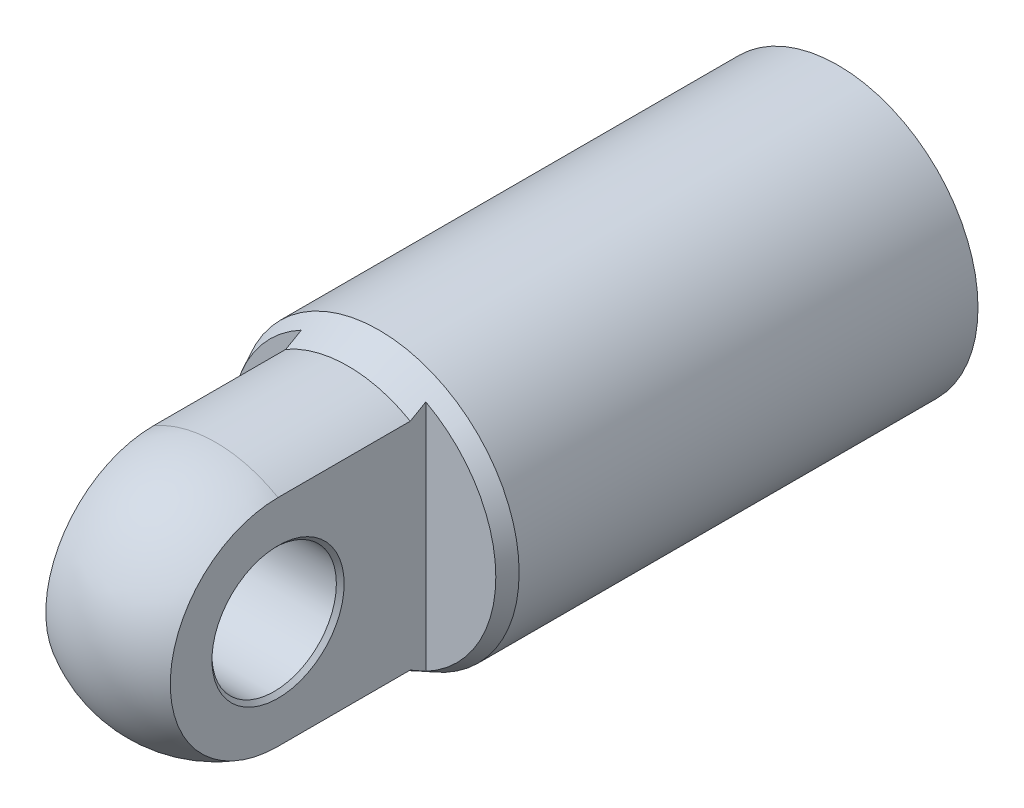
ISO-10303-21;
HEADER;
FILE_DESCRIPTION(('STEP AP214'),'2;1');
FILE_NAME('part.step','',(''),(''),'','','');
FILE_SCHEMA(('AUTOMOTIVE_DESIGN { 1 0 10303 214 1 1 1 1 }'));
ENDSEC;
DATA;
#1=APPLICATION_CONTEXT('core data for automotive mechanical design processes');
#2=APPLICATION_PROTOCOL_DEFINITION('international standard','automotive_design',2000,#1);
#3=PRODUCT_CONTEXT('',#1,'mechanical');
#4=PRODUCT('Part','Part','',(#3));
#5=PRODUCT_RELATED_PRODUCT_CATEGORY('part','',(#4));
#6=PRODUCT_DEFINITION_FORMATION('','',#4);
#7=PRODUCT_DEFINITION_CONTEXT('part definition',#1,'design');
#8=PRODUCT_DEFINITION('design','',#6,#7);
#9=PRODUCT_DEFINITION_SHAPE('','',#8);
#10=(LENGTH_UNIT() NAMED_UNIT(*) SI_UNIT(.MILLI.,.METRE.));
#11=(NAMED_UNIT(*) PLANE_ANGLE_UNIT() SI_UNIT($,.RADIAN.));
#12=(NAMED_UNIT(*) SI_UNIT($,.STERADIAN.) SOLID_ANGLE_UNIT());
#13=UNCERTAINTY_MEASURE_WITH_UNIT(LENGTH_MEASURE(1.E-05),#10,'distance_accuracy_value','');
#14=(GEOMETRIC_REPRESENTATION_CONTEXT(3) GLOBAL_UNCERTAINTY_ASSIGNED_CONTEXT((#13)) GLOBAL_UNIT_ASSIGNED_CONTEXT((#10,
#11,#12)) REPRESENTATION_CONTEXT('',''));
#15=CARTESIAN_POINT('',(0.,0.,0.));
#16=DIRECTION('',(0.,0.,1.));
#17=DIRECTION('',(1.,0.,0.));
#18=AXIS2_PLACEMENT_3D('',#15,#16,#17);
#19=CARTESIAN_POINT('',(4.00000000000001,0.,40.));
#20=DIRECTION('',(1.,0.,0.));
#21=DIRECTION('',(0.,0.,-1.));
#22=AXIS2_PLACEMENT_3D('',#19,#20,#21);
#23=CYLINDRICAL_SURFACE('',#22,4.);
#24=CARTESIAN_POINT('',(-3.75000000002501,0.,40.));
#25=DIRECTION('',(-1.,0.,0.));
#26=DIRECTION('',(0.,0.,1.));
#27=AXIS2_PLACEMENT_3D('',#24,#25,#26);
#28=CIRCLE('',#27,3.99999999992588);
#29=CARTESIAN_POINT('',(-3.75000000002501,0.,43.9999999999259));
#30=VERTEX_POINT('',#29);
#31=EDGE_CURVE('E116',#30,#30,#28,.T.);
#32=ORIENTED_EDGE('',*,*,#31,.T.);
#33=EDGE_LOOP('',(#32));
#34=FACE_BOUND('',#33,.T.);
#35=CARTESIAN_POINT('',(3.74999999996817,0.,40.));
#36=DIRECTION('',(1.,0.,0.));
#37=DIRECTION('',(0.,0.,-1.));
#38=AXIS2_PLACEMENT_3D('',#35,#36,#37);
#39=CIRCLE('',#38,3.99999999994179);
#40=CARTESIAN_POINT('',(3.74999999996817,0.,36.0000000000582));
#41=VERTEX_POINT('',#40);
#42=EDGE_CURVE('E113',#41,#41,#39,.T.);
#43=ORIENTED_EDGE('',*,*,#42,.T.);
#44=EDGE_LOOP('',(#43));
#45=FACE_BOUND('',#44,.T.);
#46=ADVANCED_FACE('F17',(#34,#45),#23,.F.);
#47=CARTESIAN_POINT('',(-3.99999999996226,0.,40.));
#48=DIRECTION('',(-1.,0.,0.));
#49=DIRECTION('',(0.,0.,1.));
#50=AXIS2_PLACEMENT_3D('',#47,#48,#49);
#51=CONICAL_SURFACE('',#50,4.24999999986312,0.785398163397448);
#52=ORIENTED_EDGE('',*,*,#31,.F.);
#53=EDGE_LOOP('',(#52));
#54=FACE_BOUND('',#53,.T.);
#55=CARTESIAN_POINT('',(-4.0000000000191,0.,40.));
#56=DIRECTION('',(-1.,0.,0.));
#57=DIRECTION('',(0.,0.,1.));
#58=AXIS2_PLACEMENT_3D('',#55,#56,#57);
#59=CIRCLE('',#58,4.24999999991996);
#60=CARTESIAN_POINT('',(-4.0000000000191,0.,44.24999999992));
#61=VERTEX_POINT('',#60);
#62=EDGE_CURVE('E20',#61,#61,#59,.F.);
#63=ORIENTED_EDGE('',*,*,#62,.F.);
#64=EDGE_LOOP('',(#63));
#65=FACE_BOUND('',#64,.T.);
#66=ADVANCED_FACE('F178',(#54,#65),#51,.F.);
#67=CARTESIAN_POINT('',(3.99999999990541,0.,40.));
#68=DIRECTION('',(1.,0.,0.));
#69=DIRECTION('',(0.,0.,-1.));
#70=AXIS2_PLACEMENT_3D('',#67,#68,#69);
#71=CONICAL_SURFACE('',#70,4.24999999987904,0.785398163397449);
#72=ORIENTED_EDGE('',*,*,#42,.F.);
#73=EDGE_LOOP('',(#72));
#74=FACE_BOUND('',#73,.T.);
#75=CARTESIAN_POINT('',(3.99999999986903,0.,40.));
#76=DIRECTION('',(1.,0.,0.));
#77=DIRECTION('',(0.,0.,-1.));
#78=AXIS2_PLACEMENT_3D('',#75,#76,#77);
#79=CIRCLE('',#78,4.24999999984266);
#80=CARTESIAN_POINT('',(3.99999999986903,0.,35.7500000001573));
#81=VERTEX_POINT('',#80);
#82=EDGE_CURVE('E93',#81,#81,#79,.T.);
#83=ORIENTED_EDGE('',*,*,#82,.T.);
#84=EDGE_LOOP('',(#83));
#85=FACE_BOUND('',#84,.T.);
#86=ADVANCED_FACE('F169',(#74,#85),#71,.F.);
#87=CARTESIAN_POINT('',(-4.,-7.5,30.5));
#88=DIRECTION('',(-1.,0.,0.));
#89=DIRECTION('',(0.,0.,1.));
#90=AXIS2_PLACEMENT_3D('',#87,#88,#89);
#91=PLANE('',#90);
#92=DIRECTION('',(0.,0.,-1.));
#93=VECTOR('',#92,1.);
#94=CARTESIAN_POINT('',(-4.00000000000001,6.9282032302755,40.));
#95=LINE('',#94,#93);
#96=CARTESIAN_POINT('',(-4.,6.9282032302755,31.5));
#97=VERTEX_POINT('',#96);
#98=CARTESIAN_POINT('',(-4.,6.9282032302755,40.));
#99=VERTEX_POINT('',#98);
#100=EDGE_CURVE('E152',#97,#99,#95,.F.);
#101=ORIENTED_EDGE('',*,*,#100,.F.);
#102=CARTESIAN_POINT('',(-4.,6.9282032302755,31.5));
#103=CARTESIAN_POINT('',(-4.,7.2054380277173,31.0198152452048));
#104=CARTESIAN_POINT('',(-4.,7.5,30.5));
#105=B_SPLINE_CURVE_WITH_KNOTS('',2,(#102,#103,#104),.UNSPECIFIED.,.F.,.F.,(3,3),(0.,1.),.UNSPECIFIED.);
#106=CARTESIAN_POINT('',(-4.,7.5,30.5));
#107=VERTEX_POINT('',#106);
#108=EDGE_CURVE('E83',#97,#107,#105,.T.);
#109=ORIENTED_EDGE('',*,*,#108,.T.);
#110=DIRECTION('',(0.,1.,0.));
#111=VECTOR('',#110,1.);
#112=CARTESIAN_POINT('',(-4.,-7.5,30.5));
#113=LINE('',#112,#111);
#114=CARTESIAN_POINT('',(-4.,-7.5,30.5));
#115=VERTEX_POINT('',#114);
#116=EDGE_CURVE('E80',#115,#107,#113,.T.);
#117=ORIENTED_EDGE('',*,*,#116,.F.);
#118=CARTESIAN_POINT('',(-4.,-7.5,30.5));
#119=CARTESIAN_POINT('',(-4.,-7.20543802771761,31.0198152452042));
#120=CARTESIAN_POINT('',(-4.,-6.9282032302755,31.5));
#121=B_SPLINE_CURVE_WITH_KNOTS('',2,(#118,#119,#120),.UNSPECIFIED.,.F.,.F.,(3,3),(0.,1.),.UNSPECIFIED.);
#122=CARTESIAN_POINT('',(-4.,-6.9282032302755,31.5));
#123=VERTEX_POINT('',#122);
#124=EDGE_CURVE('E73',#115,#123,#121,.T.);
#125=ORIENTED_EDGE('',*,*,#124,.T.);
#126=DIRECTION('',(0.,0.,-1.));
#127=VECTOR('',#126,1.);
#128=CARTESIAN_POINT('',(-4.00000000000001,-6.9282032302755,40.));
#129=LINE('',#128,#127);
#130=CARTESIAN_POINT('',(-4.,-6.9282032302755,40.));
#131=VERTEX_POINT('',#130);
#132=EDGE_CURVE('E78',#131,#123,#129,.T.);
#133=ORIENTED_EDGE('',*,*,#132,.F.);
#134=CARTESIAN_POINT('',(-4.,0.,40.));
#135=DIRECTION('',(1.,0.,0.));
#136=DIRECTION('',(0.,0.,-1.));
#137=AXIS2_PLACEMENT_3D('',#134,#135,#136);
#138=CIRCLE('',#137,6.92820323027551);
#139=EDGE_CURVE('E148',#99,#131,#138,.T.);
#140=ORIENTED_EDGE('',*,*,#139,.F.);
#141=EDGE_LOOP('',(#101,#109,#117,#125,#133,#140));
#142=FACE_BOUND('',#141,.T.);
#143=ORIENTED_EDGE('',*,*,#62,.T.);
#144=EDGE_LOOP('',(#143));
#145=FACE_BOUND('',#144,.T.);
#146=ADVANCED_FACE('F76',(#142,#145),#91,.T.);
#147=CARTESIAN_POINT('',(0.,0.,40.));
#148=DIRECTION('',(1.,0.,0.));
#149=DIRECTION('',(0.,0.,1.));
#150=AXIS2_PLACEMENT_3D('',#147,#148,#149);
#151=SPHERICAL_SURFACE('',#150,8.);
#152=CARTESIAN_POINT('',(0.,0.,40.));
#153=DIRECTION('',(0.,0.,-1.));
#154=DIRECTION('',(-1.,0.,0.));
#155=AXIS2_PLACEMENT_3D('',#152,#153,#154);
#156=CIRCLE('',#155,8.);
#157=CARTESIAN_POINT('',(4.00000000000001,6.9282032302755,40.));
#158=VERTEX_POINT('',#157);
#159=EDGE_CURVE('E104',#99,#158,#156,.T.);
#160=ORIENTED_EDGE('',*,*,#159,.F.);
#161=ORIENTED_EDGE('',*,*,#139,.T.);
#162=CARTESIAN_POINT('',(0.,0.,40.));
#163=DIRECTION('',(0.,0.,-1.));
#164=DIRECTION('',(-1.,0.,0.));
#165=AXIS2_PLACEMENT_3D('',#162,#163,#164);
#166=CIRCLE('',#165,8.);
#167=CARTESIAN_POINT('',(4.00000000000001,-6.9282032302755,40.));
#168=VERTEX_POINT('',#167);
#169=EDGE_CURVE('E91',#168,#131,#166,.T.);
#170=ORIENTED_EDGE('',*,*,#169,.F.);
#171=CARTESIAN_POINT('',(4.00000000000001,0.,40.));
#172=DIRECTION('',(1.,0.,0.));
#173=DIRECTION('',(0.,0.,-1.));
#174=AXIS2_PLACEMENT_3D('',#171,#172,#173);
#175=CIRCLE('',#174,6.9282032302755);
#176=EDGE_CURVE('E129',#168,#158,#175,.F.);
#177=ORIENTED_EDGE('',*,*,#176,.T.);
#178=EDGE_LOOP('',(#160,#161,#170,#177));
#179=FACE_BOUND('',#178,.T.);
#180=ADVANCED_FACE('F164',(#179),#151,.T.);
#181=CARTESIAN_POINT('',(4.,-7.5,30.5));
#182=DIRECTION('',(-1.,0.,0.));
#183=DIRECTION('',(0.,0.,1.));
#184=AXIS2_PLACEMENT_3D('',#181,#182,#183);
#185=PLANE('',#184);
#186=ORIENTED_EDGE('',*,*,#82,.F.);
#187=EDGE_LOOP('',(#186));
#188=FACE_BOUND('',#187,.T.);
#189=DIRECTION('',(0.,0.,-1.));
#190=VECTOR('',#189,1.);
#191=CARTESIAN_POINT('',(4.00000000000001,6.9282032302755,40.));
#192=LINE('',#191,#190);
#193=CARTESIAN_POINT('',(4.00000000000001,6.9282032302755,31.5));
#194=VERTEX_POINT('',#193);
#195=EDGE_CURVE('E101',#158,#194,#192,.T.);
#196=ORIENTED_EDGE('',*,*,#195,.F.);
#197=ORIENTED_EDGE('',*,*,#176,.F.);
#198=DIRECTION('',(0.,0.,-1.));
#199=VECTOR('',#198,1.);
#200=CARTESIAN_POINT('',(4.00000000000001,-6.9282032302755,40.));
#201=LINE('',#200,#199);
#202=CARTESIAN_POINT('',(4.00000000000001,-6.9282032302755,31.5));
#203=VERTEX_POINT('',#202);
#204=EDGE_CURVE('E92',#203,#168,#201,.F.);
#205=ORIENTED_EDGE('',*,*,#204,.F.);
#206=CARTESIAN_POINT('',(4.,-7.5,30.5));
#207=CARTESIAN_POINT('',(4.,-7.40537040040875,30.6670496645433));
#208=CARTESIAN_POINT('',(4.,-7.31040587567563,30.8339078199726));
#209=CARTESIAN_POINT('',(4.,-7.11980695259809,31.1672411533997));
#210=CARTESIAN_POINT('',(4.,-7.02417255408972,31.3337163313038));
#211=CARTESIAN_POINT('',(4.,-6.9282032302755,31.5));
#212=B_SPLINE_CURVE_WITH_KNOTS('',3,(#206,#207,#208,#209,#210,#211),.UNSPECIFIED.,.F.,.F.,(4,2,
4),(0.,0.575968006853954,1.15193615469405),.UNSPECIFIED.);
#213=CARTESIAN_POINT('',(4.,-7.5,30.5));
#214=VERTEX_POINT('',#213);
#215=EDGE_CURVE('E98',#214,#203,#212,.T.);
#216=ORIENTED_EDGE('',*,*,#215,.F.);
#217=DIRECTION('',(0.,1.,0.));
#218=VECTOR('',#217,1.);
#219=CARTESIAN_POINT('',(4.,-7.5,30.5));
#220=LINE('',#219,#218);
#221=CARTESIAN_POINT('',(4.,7.5,30.5));
#222=VERTEX_POINT('',#221);
#223=EDGE_CURVE('E111',#214,#222,#220,.T.);
#224=ORIENTED_EDGE('',*,*,#223,.T.);
#225=CARTESIAN_POINT('',(4.,6.9282032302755,31.5));
#226=CARTESIAN_POINT('',(4.,7.02417255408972,31.3337163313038));
#227=CARTESIAN_POINT('',(4.,7.11980695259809,31.1672411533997));
#228=CARTESIAN_POINT('',(4.,7.31040587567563,30.8339078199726));
#229=CARTESIAN_POINT('',(4.,7.40537040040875,30.6670496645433));
#230=CARTESIAN_POINT('',(4.,7.5,30.5));
#231=B_SPLINE_CURVE_WITH_KNOTS('',3,(#225,#226,#227,#228,#229,#230),.UNSPECIFIED.,.F.,.F.,(4,2,
4),(0.,0.575968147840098,1.15193615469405),.UNSPECIFIED.);
#232=EDGE_CURVE('E35',#194,#222,#231,.T.);
#233=ORIENTED_EDGE('',*,*,#232,.F.);
#234=EDGE_LOOP('',(#196,#197,#205,#216,#224,#233));
#235=FACE_BOUND('',#234,.T.);
#236=ADVANCED_FACE('F131',(#188,#235),#185,.F.);
#237=CARTESIAN_POINT('',(0.,0.,40.));
#238=DIRECTION('',(0.,0.,-1.));
#239=DIRECTION('',(-1.,0.,0.));
#240=AXIS2_PLACEMENT_3D('',#237,#238,#239);
#241=CYLINDRICAL_SURFACE('',#240,8.);
#242=ORIENTED_EDGE('',*,*,#204,.T.);
#243=ORIENTED_EDGE('',*,*,#169,.T.);
#244=ORIENTED_EDGE('',*,*,#132,.T.);
#245=CARTESIAN_POINT('',(0.,0.,31.5));
#246=DIRECTION('',(0.,0.,-1.));
#247=DIRECTION('',(-1.,0.,0.));
#248=AXIS2_PLACEMENT_3D('',#245,#246,#247);
#249=CIRCLE('',#248,8.);
#250=EDGE_CURVE('E89',#203,#123,#249,.T.);
#251=ORIENTED_EDGE('',*,*,#250,.F.);
#252=EDGE_LOOP('',(#242,#243,#244,#251));
#253=FACE_BOUND('',#252,.T.);
#254=ADVANCED_FACE('F88',(#253),#241,.T.);
#255=CARTESIAN_POINT('',(4.,-7.5,30.5));
#256=DIRECTION('',(0.,0.,-1.));
#257=DIRECTION('',(-1.,0.,0.));
#258=AXIS2_PLACEMENT_3D('',#255,#256,#257);
#259=PLANE('',#258);
#260=CARTESIAN_POINT('',(0.,0.,30.5));
#261=DIRECTION('',(0.,0.,-1.));
#262=DIRECTION('',(-1.,0.,0.));
#263=AXIS2_PLACEMENT_3D('',#260,#261,#262);
#264=CIRCLE('',#263,8.5);
#265=EDGE_CURVE('E100',#222,#214,#264,.T.);
#266=ORIENTED_EDGE('',*,*,#265,.F.);
#267=ORIENTED_EDGE('',*,*,#223,.F.);
#268=EDGE_LOOP('',(#266,#267));
#269=FACE_BOUND('',#268,.T.);
#270=ADVANCED_FACE('F220',(#269),#259,.F.);
#271=CARTESIAN_POINT('',(-4.,-7.5,30.5));
#272=DIRECTION('',(0.,0.,1.));
#273=DIRECTION('',(1.,0.,0.));
#274=AXIS2_PLACEMENT_3D('',#271,#272,#273);
#275=PLANE('',#274);
#276=CARTESIAN_POINT('',(0.,0.,30.5));
#277=DIRECTION('',(0.,0.,-1.));
#278=DIRECTION('',(-1.,0.,0.));
#279=AXIS2_PLACEMENT_3D('',#276,#277,#278);
#280=CIRCLE('',#279,8.5);
#281=EDGE_CURVE('E67',#115,#107,#280,.T.);
#282=ORIENTED_EDGE('',*,*,#281,.F.);
#283=ORIENTED_EDGE('',*,*,#116,.T.);
#284=EDGE_LOOP('',(#282,#283));
#285=FACE_BOUND('',#284,.T.);
#286=ADVANCED_FACE('F154',(#285),#275,.T.);
#287=CARTESIAN_POINT('',(0.,0.,40.));
#288=DIRECTION('',(0.,0.,-1.));
#289=DIRECTION('',(-1.,0.,0.));
#290=AXIS2_PLACEMENT_3D('',#287,#288,#289);
#291=CYLINDRICAL_SURFACE('',#290,8.);
#292=ORIENTED_EDGE('',*,*,#195,.T.);
#293=CARTESIAN_POINT('',(0.,0.,31.5));
#294=DIRECTION('',(0.,0.,-1.));
#295=DIRECTION('',(-1.,0.,0.));
#296=AXIS2_PLACEMENT_3D('',#293,#294,#295);
#297=CIRCLE('',#296,8.);
#298=EDGE_CURVE('E119',#97,#194,#297,.T.);
#299=ORIENTED_EDGE('',*,*,#298,.F.);
#300=ORIENTED_EDGE('',*,*,#100,.T.);
#301=ORIENTED_EDGE('',*,*,#159,.T.);
#302=EDGE_LOOP('',(#292,#299,#300,#301));
#303=FACE_BOUND('',#302,.T.);
#304=ADVANCED_FACE('F140',(#303),#291,.T.);
#305=CARTESIAN_POINT('',(0.,0.,29.5));
#306=DIRECTION('',(0.,0.,-1.));
#307=DIRECTION('',(-1.,0.,0.));
#308=AXIS2_PLACEMENT_3D('',#305,#306,#307);
#309=CONICAL_SURFACE('',#308,9.,0.463647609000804);
#310=CARTESIAN_POINT('',(0.,0.,29.5));
#311=DIRECTION('',(0.,0.,-1.));
#312=DIRECTION('',(-1.,0.,0.));
#313=AXIS2_PLACEMENT_3D('',#310,#311,#312);
#314=CIRCLE('',#313,9.);
#315=CARTESIAN_POINT('',(-9.,0.,29.5));
#316=VERTEX_POINT('',#315);
#317=EDGE_CURVE('E26',#316,#316,#314,.T.);
#318=ORIENTED_EDGE('',*,*,#317,.F.);
#319=EDGE_LOOP('',(#318));
#320=FACE_BOUND('',#319,.T.);
#321=ORIENTED_EDGE('',*,*,#298,.T.);
#322=ORIENTED_EDGE('',*,*,#232,.T.);
#323=ORIENTED_EDGE('',*,*,#265,.T.);
#324=ORIENTED_EDGE('',*,*,#215,.T.);
#325=ORIENTED_EDGE('',*,*,#250,.T.);
#326=ORIENTED_EDGE('',*,*,#124,.F.);
#327=ORIENTED_EDGE('',*,*,#281,.T.);
#328=ORIENTED_EDGE('',*,*,#108,.F.);
#329=EDGE_LOOP('',(#321,#322,#323,#324,#325,#326,#327,#328));
#330=FACE_BOUND('',#329,.T.);
#331=ADVANCED_FACE('F96',(#320,#330),#309,.T.);
#332=CARTESIAN_POINT('',(0.,0.,0.));
#333=DIRECTION('',(0.,0.,1.));
#334=DIRECTION('',(1.,0.,0.));
#335=AXIS2_PLACEMENT_3D('',#332,#333,#334);
#336=PLANE('',#335);
#337=CARTESIAN_POINT('',(0.,0.,0.));
#338=DIRECTION('',(0.,0.,-1.));
#339=DIRECTION('',(-1.,0.,0.));
#340=AXIS2_PLACEMENT_3D('',#337,#338,#339);
#341=CIRCLE('',#340,9.);
#342=CARTESIAN_POINT('',(-9.,0.,0.));
#343=VERTEX_POINT('',#342);
#344=EDGE_CURVE('E11',#343,#343,#341,.F.);
#345=ORIENTED_EDGE('',*,*,#344,.F.);
#346=EDGE_LOOP('',(#345));
#347=FACE_BOUND('',#346,.T.);
#348=ADVANCED_FACE('F139',(#347),#336,.F.);
#349=CARTESIAN_POINT('',(0.,0.,31.5));
#350=DIRECTION('',(0.,0.,-1.));
#351=DIRECTION('',(-1.,0.,0.));
#352=AXIS2_PLACEMENT_3D('',#349,#350,#351);
#353=CYLINDRICAL_SURFACE('',#352,9.);
#354=ORIENTED_EDGE('',*,*,#344,.T.);
#355=EDGE_LOOP('',(#354));
#356=FACE_BOUND('',#355,.T.);
#357=ORIENTED_EDGE('',*,*,#317,.T.);
#358=EDGE_LOOP('',(#357));
#359=FACE_BOUND('',#358,.T.);
#360=ADVANCED_FACE('F189',(#356,#359),#353,.T.);
#361=CLOSED_SHELL('',(#46,#66,#86,#146,#180,#236,#254,#270,#286,#304,#331,#348,#360));
#362=MANIFOLD_SOLID_BREP('B1',#361);
#363=ADVANCED_BREP_SHAPE_REPRESENTATION('',(#18,#362),#14);
#364=SHAPE_DEFINITION_REPRESENTATION(#9,#363);
ENDSEC;
END-ISO-10303-21;
